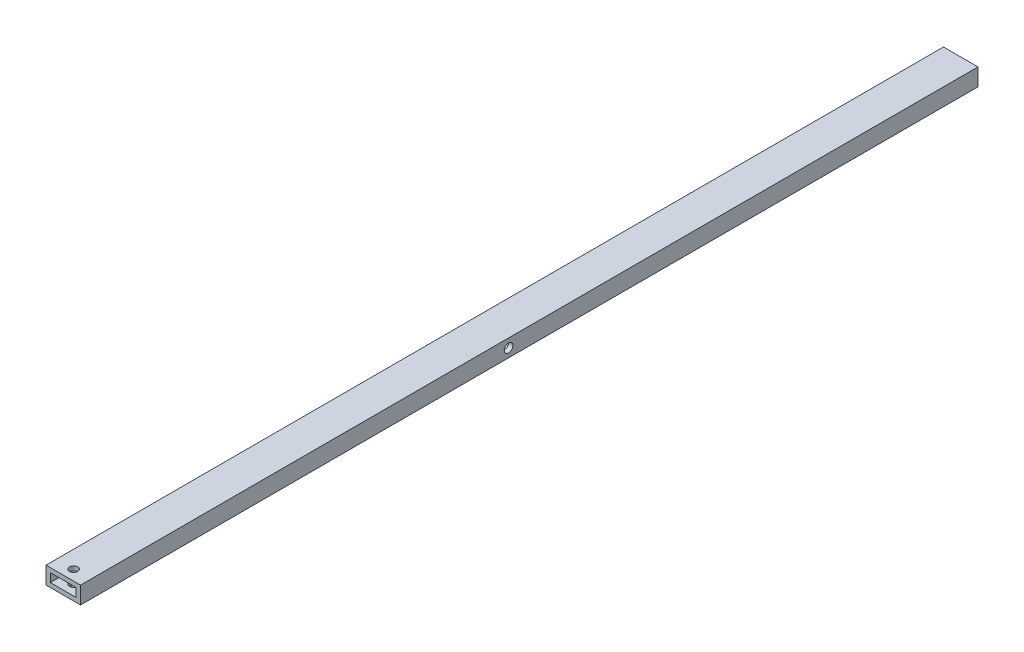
from build123d import *

# Parameters (mm, degrees)
BOSS_EXTRUDE1_DEPTH      = 304.8
BOSS_EXTRUDE1_DEPTH_BACK = 304.8
SKETCH3_W                = 12.7
SKETCH3_H                = 6.35
SKETCH3_W_2              = 9.525
SKETCH3_H_2              = 3.175
SKETCH4_R                = 1.5
CUT_EXTRUDE1_DEPTH       = 305.93226297
SKETCH6_R                = 1.5875
CUT_EXTRUDE2_DEPTH       = 306.080990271
SKETCH7_W                = 12.7
SKETCH7_H                = 6.35
CUT_EXTRUDE3_DEPTH       = 279.4


with BuildPart() as part:
    # Sketch3 → Boss-Extrude1 (new, two sides: drawn at the far end of the back side and taken through both)
    with BuildSketch(Plane.XY.offset(-BOSS_EXTRUDE1_DEPTH_BACK)):
        Rectangle(SKETCH3_W, SKETCH3_H)
        Rectangle(SKETCH3_W_2, SKETCH3_H_2, mode=Mode.SUBTRACT)
    extrude(amount=BOSS_EXTRUDE1_DEPTH + BOSS_EXTRUDE1_DEPTH_BACK)

    # Sketch4 → Cut-Extrude1 (cut, through all)
    with BuildSketch(Plane(origin=(0, 3.175, 0), x_dir=(1, 0, 0), z_dir=(0, 1, 0))):
        with Locations(Location((0, -300.99, 0), (0, 0, 270))):
            Circle(SKETCH4_R)
    extrude(amount=-CUT_EXTRUDE1_DEPTH, mode=Mode.SUBTRACT)

    # Sketch6 → Cut-Extrude2 (cut, through all)
    with BuildSketch(Plane(origin=(6.35, 0, 0), x_dir=(0, 0, -1), z_dir=(1, 0, 0))):
        with Locations(Location((-147.32, 0, 0), (0, 0, 90))):
            Circle(SKETCH6_R)
    extrude(amount=-CUT_EXTRUDE2_DEPTH, mode=Mode.SUBTRACT)

    # Sketch7 → Cut-Extrude3 (cut)
    with BuildSketch(Plane(origin=(0, 0, -304.8), x_dir=(-1, 0, 0), z_dir=(0, 0, -1))):
        Rectangle(SKETCH7_W, SKETCH7_H)
    extrude(amount=-CUT_EXTRUDE3_DEPTH, mode=Mode.SUBTRACT)


solid = part.part
